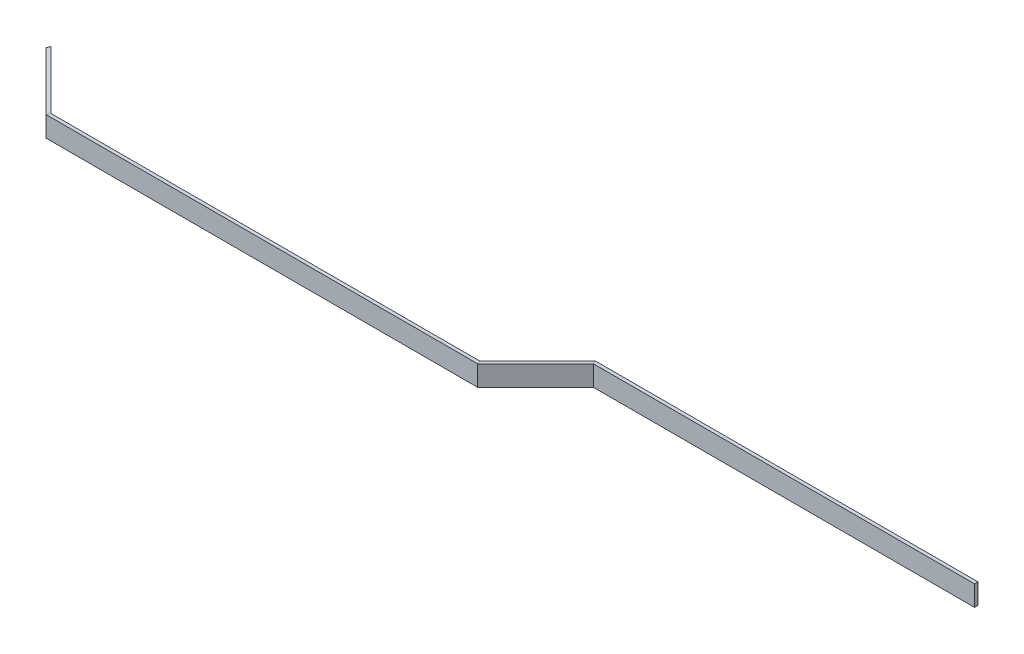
ISO-10303-21;
HEADER;
FILE_DESCRIPTION(('STEP AP214'),'2;1');
FILE_NAME('part.step','',(''),(''),'','','');
FILE_SCHEMA(('AUTOMOTIVE_DESIGN { 1 0 10303 214 1 1 1 1 }'));
ENDSEC;
DATA;
#1=APPLICATION_CONTEXT('core data for automotive mechanical design processes');
#2=APPLICATION_PROTOCOL_DEFINITION('international standard','automotive_design',2000,#1);
#3=PRODUCT_CONTEXT('',#1,'mechanical');
#4=PRODUCT('Part','Part','',(#3));
#5=PRODUCT_RELATED_PRODUCT_CATEGORY('part','',(#4));
#6=PRODUCT_DEFINITION_FORMATION('','',#4);
#7=PRODUCT_DEFINITION_CONTEXT('part definition',#1,'design');
#8=PRODUCT_DEFINITION('design','',#6,#7);
#9=PRODUCT_DEFINITION_SHAPE('','',#8);
#10=(LENGTH_UNIT() NAMED_UNIT(*) SI_UNIT(.MILLI.,.METRE.));
#11=(NAMED_UNIT(*) PLANE_ANGLE_UNIT() SI_UNIT($,.RADIAN.));
#12=(NAMED_UNIT(*) SI_UNIT($,.STERADIAN.) SOLID_ANGLE_UNIT());
#13=UNCERTAINTY_MEASURE_WITH_UNIT(LENGTH_MEASURE(1.E-05),#10,'distance_accuracy_value','');
#14=(GEOMETRIC_REPRESENTATION_CONTEXT(3) GLOBAL_UNCERTAINTY_ASSIGNED_CONTEXT((#13)) GLOBAL_UNIT_ASSIGNED_CONTEXT((#10,
#11,#12)) REPRESENTATION_CONTEXT('',''));
#15=CARTESIAN_POINT('',(0.,0.,0.));
#16=DIRECTION('',(0.,0.,1.));
#17=DIRECTION('',(1.,0.,0.));
#18=AXIS2_PLACEMENT_3D('',#15,#16,#17);
#19=CARTESIAN_POINT('',(508.,0.,-101.600000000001));
#20=DIRECTION('',(0.,0.,1.));
#21=DIRECTION('',(1.,0.,0.));
#22=AXIS2_PLACEMENT_3D('',#19,#20,#21);
#23=PLANE('',#22);
#24=DIRECTION('',(0.,1.,0.));
#25=VECTOR('',#24,1.);
#26=CARTESIAN_POINT('',(510.630256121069,0.,-101.600000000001));
#27=LINE('',#26,#25);
#28=CARTESIAN_POINT('',(510.630256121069,-38.1,-101.600000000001));
#29=VERTEX_POINT('',#28);
#30=CARTESIAN_POINT('',(510.630256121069,0.,-101.600000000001));
#31=VERTEX_POINT('',#30);
#32=EDGE_CURVE('E91',#29,#31,#27,.T.);
#33=ORIENTED_EDGE('',*,*,#32,.F.);
#34=DIRECTION('',(1.,0.,0.));
#35=VECTOR('',#34,1.);
#36=CARTESIAN_POINT('',(508.,-38.1,-101.600000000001));
#37=LINE('',#36,#35);
#38=CARTESIAN_POINT('',(1221.74,-38.1,-101.600000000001));
#39=VERTEX_POINT('',#38);
#40=EDGE_CURVE('E157',#29,#39,#37,.T.);
#41=ORIENTED_EDGE('',*,*,#40,.T.);
#42=DIRECTION('',(0.,-1.,0.));
#43=VECTOR('',#42,1.);
#44=CARTESIAN_POINT('',(1221.74,0.,-101.600000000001));
#45=LINE('',#44,#43);
#46=CARTESIAN_POINT('',(1221.74,0.,-101.600000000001));
#47=VERTEX_POINT('',#46);
#48=EDGE_CURVE('E123',#47,#39,#45,.T.);
#49=ORIENTED_EDGE('',*,*,#48,.F.);
#50=DIRECTION('',(1.,0.,0.));
#51=VECTOR('',#50,1.);
#52=CARTESIAN_POINT('',(508.,0.,-101.600000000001));
#53=LINE('',#52,#51);
#54=EDGE_CURVE('E43',#31,#47,#53,.T.);
#55=ORIENTED_EDGE('',*,*,#54,.F.);
#56=EDGE_LOOP('',(#33,#41,#49,#55));
#57=FACE_BOUND('',#56,.T.);
#58=ADVANCED_FACE('F39',(#57),#23,.T.);
#59=CARTESIAN_POINT('',(508.,-38.1,-107.950000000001));
#60=DIRECTION('',(0.,-1.,0.));
#61=DIRECTION('',(0.,0.,-1.));
#62=AXIS2_PLACEMENT_3D('',#59,#60,#61);
#63=PLANE('',#62);
#64=DIRECTION('',(0.382683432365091,0.,0.923879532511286));
#65=VECTOR('',#64,1.);
#66=CARTESIAN_POINT('',(530.79553298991,-38.1,-52.9167150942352));
#67=LINE('',#66,#65);
#68=CARTESIAN_POINT('',(508.,-38.1,-107.950000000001));
#69=VERTEX_POINT('',#68);
#70=EDGE_CURVE('E133',#69,#29,#67,.T.);
#71=ORIENTED_EDGE('',*,*,#70,.F.);
#72=DIRECTION('',(1.,0.,0.));
#73=VECTOR('',#72,1.);
#74=CARTESIAN_POINT('',(508.,-38.1,-107.950000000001));
#75=LINE('',#74,#73);
#76=CARTESIAN_POINT('',(1221.74,-38.1,-107.950000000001));
#77=VERTEX_POINT('',#76);
#78=EDGE_CURVE('E106',#69,#77,#75,.T.);
#79=ORIENTED_EDGE('',*,*,#78,.T.);
#80=DIRECTION('',(0.,0.,-1.));
#81=VECTOR('',#80,1.);
#82=CARTESIAN_POINT('',(1221.74,-38.1,-101.600000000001));
#83=LINE('',#82,#81);
#84=EDGE_CURVE('E284',#39,#77,#83,.T.);
#85=ORIENTED_EDGE('',*,*,#84,.F.);
#86=ORIENTED_EDGE('',*,*,#40,.F.);
#87=EDGE_LOOP('',(#71,#79,#85,#86));
#88=FACE_BOUND('',#87,.T.);
#89=ADVANCED_FACE('F283',(#88),#63,.T.);
#90=CARTESIAN_POINT('',(508.,0.,-107.950000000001));
#91=DIRECTION('',(0.,0.,-1.));
#92=DIRECTION('',(-1.,0.,0.));
#93=AXIS2_PLACEMENT_3D('',#90,#91,#92);
#94=PLANE('',#93);
#95=DIRECTION('',(1.,0.,0.));
#96=VECTOR('',#95,1.);
#97=CARTESIAN_POINT('',(508.,0.,-107.950000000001));
#98=LINE('',#97,#96);
#99=CARTESIAN_POINT('',(508.,0.,-107.950000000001));
#100=VERTEX_POINT('',#99);
#101=CARTESIAN_POINT('',(1221.74,0.,-107.950000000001));
#102=VERTEX_POINT('',#101);
#103=EDGE_CURVE('E103',#100,#102,#98,.T.);
#104=ORIENTED_EDGE('',*,*,#103,.T.);
#105=DIRECTION('',(0.,1.,0.));
#106=VECTOR('',#105,1.);
#107=CARTESIAN_POINT('',(1221.74,-38.1,-107.950000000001));
#108=LINE('',#107,#106);
#109=EDGE_CURVE('E169',#77,#102,#108,.T.);
#110=ORIENTED_EDGE('',*,*,#109,.F.);
#111=ORIENTED_EDGE('',*,*,#78,.F.);
#112=DIRECTION('',(0.,1.,0.));
#113=VECTOR('',#112,1.);
#114=CARTESIAN_POINT('',(508.,0.,-107.950000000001));
#115=LINE('',#114,#113);
#116=EDGE_CURVE('E98',#69,#100,#115,.T.);
#117=ORIENTED_EDGE('',*,*,#116,.T.);
#118=EDGE_LOOP('',(#104,#110,#111,#117));
#119=FACE_BOUND('',#118,.T.);
#120=ADVANCED_FACE('F100',(#119),#94,.T.);
#121=CARTESIAN_POINT('',(508.,0.,-101.600000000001));
#122=DIRECTION('',(0.,1.,0.));
#123=DIRECTION('',(0.,0.,1.));
#124=AXIS2_PLACEMENT_3D('',#121,#122,#123);
#125=PLANE('',#124);
#126=DIRECTION('',(-0.382683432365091,0.,-0.923879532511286));
#127=VECTOR('',#126,1.);
#128=CARTESIAN_POINT('',(533.040597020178,0.,-47.496651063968));
#129=LINE('',#128,#127);
#130=EDGE_CURVE('E119',#31,#100,#129,.T.);
#131=ORIENTED_EDGE('',*,*,#130,.F.);
#132=ORIENTED_EDGE('',*,*,#54,.T.);
#133=DIRECTION('',(0.,0.,1.));
#134=VECTOR('',#133,1.);
#135=CARTESIAN_POINT('',(1221.74,0.,-107.950000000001));
#136=LINE('',#135,#134);
#137=EDGE_CURVE('E121',#102,#47,#136,.T.);
#138=ORIENTED_EDGE('',*,*,#137,.F.);
#139=ORIENTED_EDGE('',*,*,#103,.F.);
#140=EDGE_LOOP('',(#131,#132,#138,#139));
#141=FACE_BOUND('',#140,.T.);
#142=ADVANCED_FACE('F41',(#141),#125,.T.);
#143=CARTESIAN_POINT('',(397.933430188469,0.,2.11656981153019));
#144=DIRECTION('',(-0.707106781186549,0.,-0.707106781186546));
#145=DIRECTION('',(-0.707106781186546,0.,0.707106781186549));
#146=AXIS2_PLACEMENT_3D('',#143,#144,#145);
#147=PLANE('',#146);
#148=DIRECTION('',(0.,-1.,0.));
#149=VECTOR('',#148,1.);
#150=CARTESIAN_POINT('',(400.05,0.,-3.96062098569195E-13));
#151=LINE('',#150,#149);
#152=CARTESIAN_POINT('',(400.05,0.,-4.22460898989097E-13));
#153=VERTEX_POINT('',#152);
#154=CARTESIAN_POINT('',(400.05,-38.1,-4.09910497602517E-13));
#155=VERTEX_POINT('',#154);
#156=EDGE_CURVE('E137',#153,#155,#151,.T.);
#157=ORIENTED_EDGE('',*,*,#156,.F.);
#158=DIRECTION('',(0.707106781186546,0.,-0.707106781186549));
#159=VECTOR('',#158,1.);
#160=CARTESIAN_POINT('',(397.933430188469,0.,2.11656981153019));
#161=LINE('',#160,#159);
#162=EDGE_CURVE('E113',#153,#100,#161,.T.);
#163=ORIENTED_EDGE('',*,*,#162,.T.);
#164=ORIENTED_EDGE('',*,*,#116,.F.);
#165=DIRECTION('',(0.707106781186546,0.,-0.707106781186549));
#166=VECTOR('',#165,1.);
#167=CARTESIAN_POINT('',(397.933430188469,-38.1,2.11656981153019));
#168=LINE('',#167,#166);
#169=EDGE_CURVE('E139',#155,#69,#168,.T.);
#170=ORIENTED_EDGE('',*,*,#169,.F.);
#171=EDGE_LOOP('',(#157,#163,#164,#170));
#172=FACE_BOUND('',#171,.T.);
#173=ADVANCED_FACE('F135',(#172),#147,.T.);
#174=CARTESIAN_POINT('',(402.423558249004,0.,6.60669787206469));
#175=DIRECTION('',(0.707106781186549,0.,0.707106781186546));
#176=DIRECTION('',(0.707106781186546,0.,-0.707106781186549));
#177=AXIS2_PLACEMENT_3D('',#174,#175,#176);
#178=PLANE('',#177);
#179=DIRECTION('',(0.707106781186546,0.,-0.707106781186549));
#180=VECTOR('',#179,1.);
#181=CARTESIAN_POINT('',(402.423558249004,-38.1,6.60669787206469));
#182=LINE('',#181,#180);
#183=CARTESIAN_POINT('',(402.680256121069,-38.1,6.34999999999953));
#184=VERTEX_POINT('',#183);
#185=EDGE_CURVE('E142',#184,#29,#182,.T.);
#186=ORIENTED_EDGE('',*,*,#185,.T.);
#187=ORIENTED_EDGE('',*,*,#32,.T.);
#188=DIRECTION('',(0.707106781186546,0.,-0.707106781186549));
#189=VECTOR('',#188,1.);
#190=CARTESIAN_POINT('',(402.423558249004,0.,6.60669787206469));
#191=LINE('',#190,#189);
#192=CARTESIAN_POINT('',(402.680256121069,0.,6.34999999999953));
#193=VERTEX_POINT('',#192);
#194=EDGE_CURVE('E131',#193,#31,#191,.T.);
#195=ORIENTED_EDGE('',*,*,#194,.F.);
#196=DIRECTION('',(0.,1.,0.));
#197=VECTOR('',#196,1.);
#198=CARTESIAN_POINT('',(402.680256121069,0.,6.3499999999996));
#199=LINE('',#198,#197);
#200=EDGE_CURVE('E226',#184,#193,#199,.T.);
#201=ORIENTED_EDGE('',*,*,#200,.F.);
#202=EDGE_LOOP('',(#186,#187,#195,#201));
#203=FACE_BOUND('',#202,.T.);
#204=ADVANCED_FACE('F290',(#203),#178,.T.);
#205=CARTESIAN_POINT('',(397.933430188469,-38.1,2.11656981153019));
#206=DIRECTION('',(0.,-1.,0.));
#207=DIRECTION('',(0.,0.,-1.));
#208=AXIS2_PLACEMENT_3D('',#205,#206,#207);
#209=PLANE('',#208);
#210=ORIENTED_EDGE('',*,*,#169,.T.);
#211=ORIENTED_EDGE('',*,*,#70,.T.);
#212=ORIENTED_EDGE('',*,*,#185,.F.);
#213=DIRECTION('',(0.382683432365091,0.,0.923879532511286));
#214=VECTOR('',#213,1.);
#215=CARTESIAN_POINT('',(282.439711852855,-38.1,-283.936352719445));
#216=LINE('',#215,#214);
#217=EDGE_CURVE('E203',#155,#184,#216,.T.);
#218=ORIENTED_EDGE('',*,*,#217,.F.);
#219=EDGE_LOOP('',(#210,#211,#212,#218));
#220=FACE_BOUND('',#219,.T.);
#221=ADVANCED_FACE('F289',(#220),#209,.T.);
#222=CARTESIAN_POINT('',(402.423558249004,0.,6.60669787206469));
#223=DIRECTION('',(0.,1.,0.));
#224=DIRECTION('',(0.,0.,1.));
#225=AXIS2_PLACEMENT_3D('',#222,#223,#224);
#226=PLANE('',#225);
#227=ORIENTED_EDGE('',*,*,#194,.T.);
#228=ORIENTED_EDGE('',*,*,#130,.T.);
#229=ORIENTED_EDGE('',*,*,#162,.F.);
#230=DIRECTION('',(-0.382683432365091,0.,-0.923879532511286));
#231=VECTOR('',#230,1.);
#232=CARTESIAN_POINT('',(284.684775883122,0.,-278.516288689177));
#233=LINE('',#232,#231);
#234=EDGE_CURVE('E223',#193,#153,#233,.T.);
#235=ORIENTED_EDGE('',*,*,#234,.F.);
#236=EDGE_LOOP('',(#227,#228,#229,#235));
#237=FACE_BOUND('',#236,.T.);
#238=ADVANCED_FACE('F128',(#237),#226,.T.);
#239=CARTESIAN_POINT('',(-403.043281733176,0.,6.34999999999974));
#240=DIRECTION('',(0.,1.,0.));
#241=DIRECTION('',(0.,0.,1.));
#242=AXIS2_PLACEMENT_3D('',#239,#240,#241);
#243=PLANE('',#242);
#244=DIRECTION('',(1.,0.,0.));
#245=VECTOR('',#244,1.);
#246=CARTESIAN_POINT('',(-403.043281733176,0.,6.34999999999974));
#247=LINE('',#246,#245);
#248=CARTESIAN_POINT('',(-402.680256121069,0.,6.34999999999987));
#249=VERTEX_POINT('',#248);
#250=EDGE_CURVE('E237',#249,#193,#247,.T.);
#251=ORIENTED_EDGE('',*,*,#250,.T.);
#252=ORIENTED_EDGE('',*,*,#234,.T.);
#253=DIRECTION('',(1.,0.,0.));
#254=VECTOR('',#253,1.);
#255=CARTESIAN_POINT('',(-403.043281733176,0.,-2.4980018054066E-13));
#256=LINE('',#255,#254);
#257=CARTESIAN_POINT('',(-400.05,0.,-1.66806026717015E-13));
#258=VERTEX_POINT('',#257);
#259=EDGE_CURVE('E112',#258,#153,#256,.T.);
#260=ORIENTED_EDGE('',*,*,#259,.F.);
#261=DIRECTION('',(0.382683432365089,0.,-0.923879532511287));
#262=VECTOR('',#261,1.);
#263=CARTESIAN_POINT('',(-379.93788700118,0.,-48.5549359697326));
#264=LINE('',#263,#262);
#265=EDGE_CURVE('E193',#249,#258,#264,.T.);
#266=ORIENTED_EDGE('',*,*,#265,.F.);
#267=EDGE_LOOP('',(#251,#252,#260,#266));
#268=FACE_BOUND('',#267,.T.);
#269=ADVANCED_FACE('F250',(#268),#243,.T.);
#270=CARTESIAN_POINT('',(-403.043281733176,0.,-2.4980018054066E-13));
#271=DIRECTION('',(0.,0.,-1.));
#272=DIRECTION('',(-1.,0.,0.));
#273=AXIS2_PLACEMENT_3D('',#270,#271,#272);
#274=PLANE('',#273);
#275=ORIENTED_EDGE('',*,*,#259,.T.);
#276=ORIENTED_EDGE('',*,*,#156,.T.);
#277=DIRECTION('',(1.,0.,0.));
#278=VECTOR('',#277,1.);
#279=CARTESIAN_POINT('',(-403.043281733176,-38.1,-2.4980018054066E-13));
#280=LINE('',#279,#278);
#281=CARTESIAN_POINT('',(-400.05,-38.1,-1.70681288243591E-13));
#282=VERTEX_POINT('',#281);
#283=EDGE_CURVE('E230',#282,#155,#280,.T.);
#284=ORIENTED_EDGE('',*,*,#283,.F.);
#285=DIRECTION('',(0.,-1.,0.));
#286=VECTOR('',#285,1.);
#287=CARTESIAN_POINT('',(-400.05,0.,0.));
#288=LINE('',#287,#286);
#289=EDGE_CURVE('E189',#258,#282,#288,.T.);
#290=ORIENTED_EDGE('',*,*,#289,.F.);
#291=EDGE_LOOP('',(#275,#276,#284,#290));
#292=FACE_BOUND('',#291,.T.);
#293=ADVANCED_FACE('F316',(#292),#274,.T.);
#294=CARTESIAN_POINT('',(-403.043281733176,-38.1,-2.4980018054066E-13));
#295=DIRECTION('',(0.,-1.,0.));
#296=DIRECTION('',(0.,0.,-1.));
#297=AXIS2_PLACEMENT_3D('',#294,#295,#296);
#298=PLANE('',#297);
#299=ORIENTED_EDGE('',*,*,#283,.T.);
#300=ORIENTED_EDGE('',*,*,#217,.T.);
#301=DIRECTION('',(1.,0.,0.));
#302=VECTOR('',#301,1.);
#303=CARTESIAN_POINT('',(-403.043281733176,-38.1,6.34999999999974));
#304=LINE('',#303,#302);
#305=CARTESIAN_POINT('',(-402.680256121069,-38.1,6.34999999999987));
#306=VERTEX_POINT('',#305);
#307=EDGE_CURVE('E233',#306,#184,#304,.T.);
#308=ORIENTED_EDGE('',*,*,#307,.F.);
#309=DIRECTION('',(-0.382683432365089,0.,0.923879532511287));
#310=VECTOR('',#309,1.);
#311=CARTESIAN_POINT('',(-377.692822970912,-38.1,-53.9749999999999));
#312=LINE('',#311,#310);
#313=EDGE_CURVE('E59',#282,#306,#312,.T.);
#314=ORIENTED_EDGE('',*,*,#313,.F.);
#315=EDGE_LOOP('',(#299,#300,#308,#314));
#316=FACE_BOUND('',#315,.T.);
#317=ADVANCED_FACE('F313',(#316),#298,.T.);
#318=CARTESIAN_POINT('',(-403.043281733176,0.,6.34999999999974));
#319=DIRECTION('',(0.,0.,1.));
#320=DIRECTION('',(1.,0.,0.));
#321=AXIS2_PLACEMENT_3D('',#318,#319,#320);
#322=PLANE('',#321);
#323=ORIENTED_EDGE('',*,*,#307,.T.);
#324=ORIENTED_EDGE('',*,*,#200,.T.);
#325=ORIENTED_EDGE('',*,*,#250,.F.);
#326=DIRECTION('',(0.,1.,0.));
#327=VECTOR('',#326,1.);
#328=CARTESIAN_POINT('',(-402.680256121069,0.,6.34999999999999));
#329=LINE('',#328,#327);
#330=EDGE_CURVE('E197',#306,#249,#329,.T.);
#331=ORIENTED_EDGE('',*,*,#330,.F.);
#332=EDGE_LOOP('',(#323,#324,#325,#331));
#333=FACE_BOUND('',#332,.T.);
#334=ADVANCED_FACE('F244',(#333),#322,.T.);
#335=CARTESIAN_POINT('',(-512.490128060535,0.,-103.459871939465));
#336=DIRECTION('',(0.,1.,0.));
#337=DIRECTION('',(0.,0.,1.));
#338=AXIS2_PLACEMENT_3D('',#335,#336,#337);
#339=PLANE('',#338);
#340=DIRECTION('',(0.707106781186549,0.,0.707106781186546));
#341=VECTOR('',#340,1.);
#342=CARTESIAN_POINT('',(-512.490128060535,0.,-103.459871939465));
#343=LINE('',#342,#341);
#344=CARTESIAN_POINT('',(-510.630256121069,0.,-101.6));
#345=VERTEX_POINT('',#344);
#346=EDGE_CURVE('E211',#345,#249,#343,.T.);
#347=ORIENTED_EDGE('',*,*,#346,.T.);
#348=ORIENTED_EDGE('',*,*,#265,.T.);
#349=DIRECTION('',(0.707106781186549,0.,0.707106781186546));
#350=VECTOR('',#349,1.);
#351=CARTESIAN_POINT('',(-508.,0.,-107.95));
#352=LINE('',#351,#350);
#353=CARTESIAN_POINT('',(-508.,0.,-107.95));
#354=VERTEX_POINT('',#353);
#355=EDGE_CURVE('E198',#354,#258,#352,.T.);
#356=ORIENTED_EDGE('',*,*,#355,.F.);
#357=DIRECTION('',(0.382683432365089,0.,-0.923879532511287));
#358=VECTOR('',#357,1.);
#359=CARTESIAN_POINT('',(-614.397892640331,0.,148.917235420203));
#360=LINE('',#359,#358);
#361=EDGE_CURVE('E180',#345,#354,#360,.T.);
#362=ORIENTED_EDGE('',*,*,#361,.F.);
#363=EDGE_LOOP('',(#347,#348,#356,#362));
#364=FACE_BOUND('',#363,.T.);
#365=ADVANCED_FACE('F254',(#364),#339,.T.);
#366=CARTESIAN_POINT('',(-508.,0.,-107.95));
#367=DIRECTION('',(0.707106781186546,0.,-0.707106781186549));
#368=DIRECTION('',(-0.707106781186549,0.,-0.707106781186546));
#369=AXIS2_PLACEMENT_3D('',#366,#367,#368);
#370=PLANE('',#369);
#371=ORIENTED_EDGE('',*,*,#355,.T.);
#372=ORIENTED_EDGE('',*,*,#289,.T.);
#373=DIRECTION('',(0.707106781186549,0.,0.707106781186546));
#374=VECTOR('',#373,1.);
#375=CARTESIAN_POINT('',(-508.,-38.1,-107.95));
#376=LINE('',#375,#374);
#377=CARTESIAN_POINT('',(-508.,-38.1,-107.95));
#378=VERTEX_POINT('',#377);
#379=EDGE_CURVE('E202',#378,#282,#376,.T.);
#380=ORIENTED_EDGE('',*,*,#379,.F.);
#381=DIRECTION('',(0.,1.,0.));
#382=VECTOR('',#381,1.);
#383=CARTESIAN_POINT('',(-508.,0.,-107.95));
#384=LINE('',#383,#382);
#385=EDGE_CURVE('E11',#378,#354,#384,.T.);
#386=ORIENTED_EDGE('',*,*,#385,.T.);
#387=EDGE_LOOP('',(#371,#372,#380,#386));
#388=FACE_BOUND('',#387,.T.);
#389=ADVANCED_FACE('F259',(#388),#370,.T.);
#390=CARTESIAN_POINT('',(-508.,-38.1,-107.95));
#391=DIRECTION('',(0.,-1.,0.));
#392=DIRECTION('',(0.,0.,-1.));
#393=AXIS2_PLACEMENT_3D('',#390,#391,#392);
#394=PLANE('',#393);
#395=ORIENTED_EDGE('',*,*,#379,.T.);
#396=ORIENTED_EDGE('',*,*,#313,.T.);
#397=DIRECTION('',(0.707106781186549,0.,0.707106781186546));
#398=VECTOR('',#397,1.);
#399=CARTESIAN_POINT('',(-512.490128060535,-38.1,-103.459871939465));
#400=LINE('',#399,#398);
#401=CARTESIAN_POINT('',(-510.630256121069,-38.1,-101.6));
#402=VERTEX_POINT('',#401);
#403=EDGE_CURVE('E207',#402,#306,#400,.T.);
#404=ORIENTED_EDGE('',*,*,#403,.F.);
#405=DIRECTION('',(-0.382683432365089,0.,0.923879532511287));
#406=VECTOR('',#405,1.);
#407=CARTESIAN_POINT('',(-612.152828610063,-38.1,143.497171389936));
#408=LINE('',#407,#406);
#409=EDGE_CURVE('E176',#378,#402,#408,.T.);
#410=ORIENTED_EDGE('',*,*,#409,.F.);
#411=EDGE_LOOP('',(#395,#396,#404,#410));
#412=FACE_BOUND('',#411,.T.);
#413=ADVANCED_FACE('F273',(#412),#394,.T.);
#414=CARTESIAN_POINT('',(-512.490128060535,0.,-103.459871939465));
#415=DIRECTION('',(-0.707106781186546,0.,0.707106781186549));
#416=DIRECTION('',(0.707106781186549,0.,0.707106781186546));
#417=AXIS2_PLACEMENT_3D('',#414,#415,#416);
#418=PLANE('',#417);
#419=ORIENTED_EDGE('',*,*,#403,.T.);
#420=ORIENTED_EDGE('',*,*,#330,.T.);
#421=ORIENTED_EDGE('',*,*,#346,.F.);
#422=DIRECTION('',(0.,1.,0.));
#423=VECTOR('',#422,1.);
#424=CARTESIAN_POINT('',(-510.630256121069,0.,-101.6));
#425=LINE('',#424,#423);
#426=EDGE_CURVE('E50',#402,#345,#425,.T.);
#427=ORIENTED_EDGE('',*,*,#426,.F.);
#428=EDGE_LOOP('',(#419,#420,#421,#427));
#429=FACE_BOUND('',#428,.T.);
#430=ADVANCED_FACE('F276',(#429),#418,.T.);
#431=CARTESIAN_POINT('',(1221.74,0.,0.));
#432=DIRECTION('',(1.,0.,0.));
#433=DIRECTION('',(0.,0.,-1.));
#434=AXIS2_PLACEMENT_3D('',#431,#432,#433);
#435=PLANE('',#434);
#436=ORIENTED_EDGE('',*,*,#84,.T.);
#437=ORIENTED_EDGE('',*,*,#109,.T.);
#438=ORIENTED_EDGE('',*,*,#137,.T.);
#439=ORIENTED_EDGE('',*,*,#48,.T.);
#440=EDGE_LOOP('',(#436,#437,#438,#439));
#441=FACE_BOUND('',#440,.T.);
#442=ADVANCED_FACE('F167',(#441),#435,.T.);
#443=CARTESIAN_POINT('',(-510.630256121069,0.,-101.6));
#444=DIRECTION('',(-0.923879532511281,0.,-0.382683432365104));
#445=DIRECTION('',(-0.382683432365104,0.,0.923879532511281));
#446=AXIS2_PLACEMENT_3D('',#443,#444,#445);
#447=PLANE('',#446);
#448=ORIENTED_EDGE('',*,*,#409,.T.);
#449=ORIENTED_EDGE('',*,*,#426,.T.);
#450=ORIENTED_EDGE('',*,*,#361,.T.);
#451=ORIENTED_EDGE('',*,*,#385,.F.);
#452=EDGE_LOOP('',(#448,#449,#450,#451));
#453=FACE_BOUND('',#452,.T.);
#454=ADVANCED_FACE('F268',(#453),#447,.T.);
#455=CLOSED_SHELL('',(#58,#89,#120,#142,#173,#204,#221,#238,#269,#293,#317,#334,#365,#389,#413,
#430,#442,#454));
#456=MANIFOLD_SOLID_BREP('B2',#455);
#457=ADVANCED_BREP_SHAPE_REPRESENTATION('',(#18,#456),#14);
#458=SHAPE_DEFINITION_REPRESENTATION(#9,#457);
ENDSEC;
END-ISO-10303-21;
